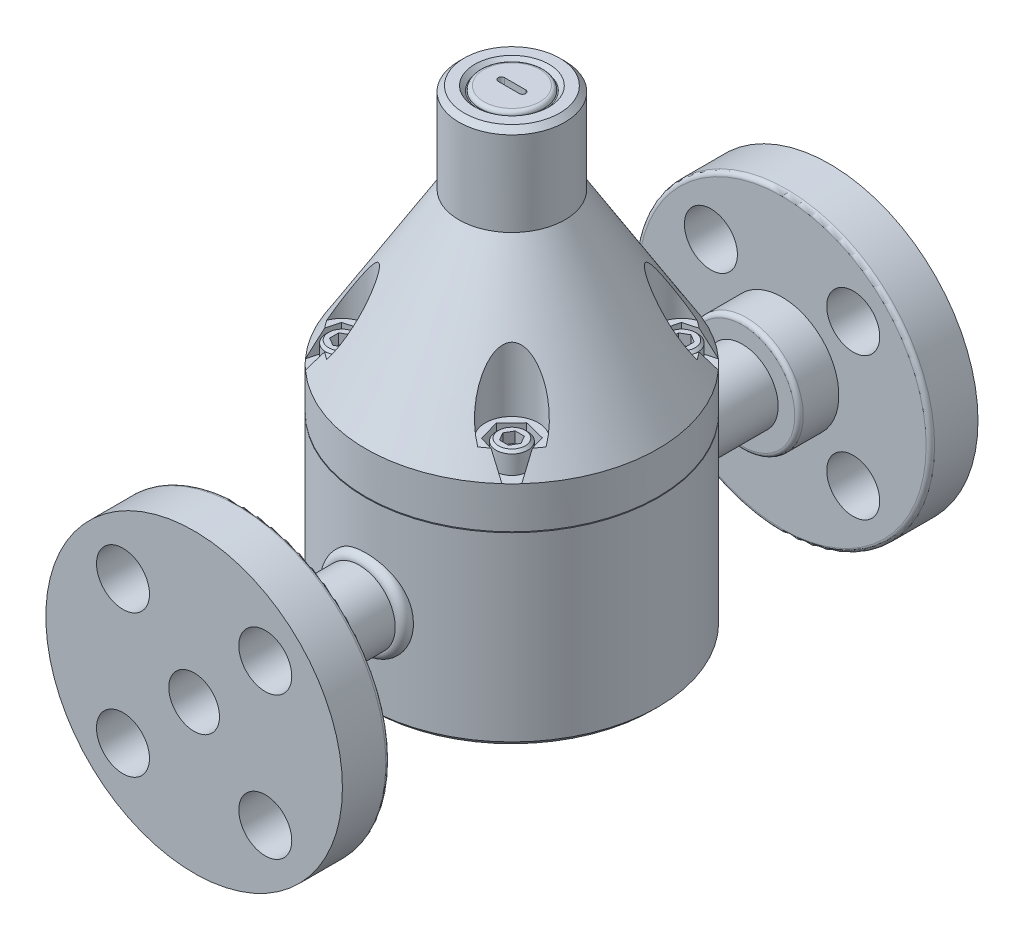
from build123d import *

# Parameters (mm, degrees)
SKETCH1_R                = 43.815
EXTRUDE1_DEPTH           = 140.97
SKETCH3_R                = 11.1125
EXTRUDE2_DEPTH           = 1.27
EXTRUDE2_DRAFT           = -45
CHAMFER1_SIZE            = 1.5748
SKETCH4_R                = 9.525
EXTRUDE3_DEPTH           = 1.27
FILLET1_R                = 1.143
EXTRUDE4_DEPTH           = 3.302
EXTRUDE4_DRAFT           = -1
SKETCH6_R                = 7.9375
EXTRUDE5_DEPTH           = 22.86
EXTRUDE6_DEPTH           = 6.35
CIRPATTERN1_COUNT        = 4
SKETCH9_R                = 4.7625
EXTRUDE7_DEPTH           = 6.35
EXTRUDE8_DEPTH           = 3.175
CIRPATTERN2_COUNT        = 4
CHAMFER2_SIZE            = 0.762
SKETCH11_R               = 44.45
BOSS_EXTRUDE1_DEPTH      = 14.2748
SKETCH12_R               = 17.018
BOSS_EXTRUDE2_DEPTH      = 26.2128
BOSS_EXTRUDE3_REACH      = 204.947
BOSS_EXTRUDE3_END_RADIUS = 43.815
SKETCH13_R               = 10.7696
SKETCH14_R               = 7.5946
CUT_EXTRUDE1_DEPTH       = 25.4
SKETCH15_R               = 7.9375
CUT_EXTRUDE2_DEPTH       = 25.4
CIRPATTERN3_COUNT        = 4
SKETCH18_R               = 44.45
BOSS_EXTRUDE5_DEPTH      = 14.2748
BOSS_EXTRUDE6_START      = 26.2128
SKETCH19_R               = 17.018
BOSS_EXTRUDE6_DEPTH      = 26.2128
BOSS_EXTRUDE7_REACH      = 243.119
BOSS_EXTRUDE7_END_RADIUS = 43.815
SKETCH20_R               = 10.7696
CUT_EXTRUDE3_START       = 25.4
SKETCH21_R               = 7.5946
CUT_EXTRUDE3_DEPTH       = 25.4
CUT_EXTRUDE4_START       = 25.4
SKETCH22_R               = 7.9375
CUT_EXTRUDE4_DEPTH       = 25.4
CIRPATTERN4_COUNT        = 4
FILLET3_R                = 1.27


with BuildPart() as part:
    # Sketch1 → Extrude1 (new body)
    with BuildSketch(Plane(origin=(0, 0, 0), x_dir=(1, 0, 0), z_dir=(0, 1, 0))):
        with Locations(Location((0, 0, 0), (0, 0, 270))):
            Circle(SKETCH1_R)
    extrude(amount=EXTRUDE1_DEPTH)

    # Sketch2 → Cut-Revolve1 (revolve, cut)
    with BuildSketch(Plane.XY, mode=Mode.PRIVATE) as cut_revolve1_sk:
        Polygon((-43.815, 56.134), (-43.815, 68.58), (-15.875, 114.046), (-15.875, 147.034008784), (-49.44729897, 147.034008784), (-49.44729897, 55.88), (-30.226, 55.88), (-30.226, 56.134), align=None)
    revolve(cut_revolve1_sk.sketch.rotate(Axis((0, 0, 0), (0, 1, 0)), 270), axis=Axis((0, 0, 0), (0, 1, 0)), mode=Mode.SUBTRACT)


with BuildPart() as extrude2_tool:
    # Sketch3 → Extrude2 (with draft: the straight prism first)
    with BuildSketch(Plane(origin=(0, 140.97, 0), x_dir=(-1, 0, 0), z_dir=(0, 1, 0))):
        Circle(SKETCH3_R)
    extrude(amount=-EXTRUDE2_DEPTH)
    # Extrude2: the draft: its side faces are tilted about the plane it starts from
    extrude2_sides = [extrude2_tool.faces().sort_by_distance(p)[0] for p in [
        (11.1125, 140.335, 0),
    ]]
    draft(extrude2_sides, Plane(origin=(0, 140.97, 0), x_dir=(-1, 0, 0), z_dir=(0, 1, 0)), EXTRUDE2_DRAFT)


with BuildPart() as part_1:
    add(part.part)

    # Extrude2: cut by extrude2_tool
    add(extrude2_tool.part, mode=Mode.SUBTRACT)

    # Chamfer1
    chamfer1_edges = [part_1.edges().sort_by_distance(p)[0] for p in [
        (0, 0, -43.815),
        (0, 140.97, 15.875),
    ]]
    chamfer(chamfer1_edges, length=CHAMFER1_SIZE)

    # Sketch4 → Extrude3 (add)
    with BuildSketch(Plane(origin=(0, 140.97, 0), x_dir=(-1, 0, 0), z_dir=(0, 1, 0))):
        with Locations(Location((0, 0, 0), (0, 0, 90))):
            Circle(SKETCH4_R)
    extrude(amount=-EXTRUDE3_DEPTH)

    # Fillet1
    fillet1_edges = [part_1.edges().sort_by_distance(p)[0] for p in [
        (0, 140.97, -9.525),
    ]]
    fillet(fillet1_edges, radius=FILLET1_R)


with BuildPart() as extrude4_tool:
    # Sketch5 → Extrude4 (with draft: the straight prism first)
    with BuildSketch(Plane(origin=(0, 140.97, 0), x_dir=(-1, 0, 0), z_dir=(0, 1, 0))):
        with BuildLine():
            Line((3.175, 0.9652), (-3.175, 0.9652))
            ThreePointArc((-3.175, 0.9652), (-4.1402, 0), (-3.175, -0.9652))
            Line((-3.175, -0.9652), (3.175, -0.9652))
            ThreePointArc((3.175, -0.9652), (4.1402, 0), (3.175, 0.9652))
        make_face()
    extrude(amount=-EXTRUDE4_DEPTH)
    # Extrude4: the draft: its side faces are tilted about the plane it starts from
    extrude4_sides = [extrude4_tool.faces().sort_by_distance(p)[0] for p in [
        (-4.1402, 139.319, 0),
        (0, 139.319, 0.9652),
        (4.1402, 139.319, 0),
        (0, 139.319, -0.9652),
    ]]
    draft(extrude4_sides, Plane(origin=(0, 140.97, 0), x_dir=(-1, 0, 0), z_dir=(0, 1, 0)), EXTRUDE4_DRAFT)


with BuildPart() as part_2:
    add(part_1.part)

    # Extrude4: cut by extrude4_tool
    add(extrude4_tool.part, mode=Mode.SUBTRACT)

    # Sketch6 → Extrude5 (cut)
    with BuildSketch(Plane(origin=(0, 74.93, 0), x_dir=(-1, 0, 0), z_dir=(0, 1, 0))):
        with Locations((-25.459026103, 25.459026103)):
            Circle(SKETCH6_R)
    extrude5 = extrude(amount=EXTRUDE5_DEPTH, mode=Mode.SUBTRACT)

    # Sketch8 → Extrude6 (cut)
    with BuildSketch(Plane(origin=(0, 74.93, 0), x_dir=(-1, 0, 0), z_dir=(0, 1, 0))):
        Polygon((-29.948607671, 20.824591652), (-23.690278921, 19.253717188), (-19.200697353, 23.888151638), (-20.969444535, 30.093460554), (-33.591654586, 33.591654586), align=None)
    extrude6 = extrude(amount=-EXTRUDE6_DEPTH, mode=Mode.SUBTRACT)

    # CirPattern1: Extrude5, Extrude6 ×4 about axis
    cirpattern1_axis = Axis((0, 0, 0), (0, 1, 0))
    add([extrude5.rotate(cirpattern1_axis, i * 360 / CIRPATTERN1_COUNT) for i in range(1, CIRPATTERN1_COUNT)], mode=Mode.SUBTRACT)
    add([extrude6.rotate(cirpattern1_axis, i * 360 / CIRPATTERN1_COUNT) for i in range(1, CIRPATTERN1_COUNT)], mode=Mode.SUBTRACT)

    # Sketch9 → Extrude7 (add)
    with BuildSketch(Plane(origin=(0, 74.93, 0), x_dir=(-1, 0, 0), z_dir=(0, 1, 0))):
        with Locations(Location((-25.459026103, 25.459026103, 0), (0, 0, 90))):
            Circle(SKETCH9_R)
    extrude7 = extrude(amount=-EXTRUDE7_DEPTH)

    # Sketch10 → Extrude8 (cut)
    with BuildSketch(Plane(origin=(0, 74.93, 0), x_dir=(-1, 0, 0), z_dir=(0, 1, 0))):
        Polygon((-28.187127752, 25.459026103), (-26.823076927, 23.096420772), (-24.094975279, 23.096420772), (-22.730924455, 25.459026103), (-24.094975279, 27.821631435), (-26.823076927, 27.821631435), align=None)
    extrude8 = extrude(amount=-EXTRUDE8_DEPTH, mode=Mode.SUBTRACT)

    # CirPattern2: Extrude7, Extrude8 ×4 about axis
    cirpattern2_axis = Axis((0, 0, 0), (0, 1, 0))
    add([extrude7.rotate(cirpattern2_axis, i * 360 / CIRPATTERN2_COUNT) for i in range(1, CIRPATTERN2_COUNT)])
    add([extrude8.rotate(cirpattern2_axis, i * 360 / CIRPATTERN2_COUNT) for i in range(1, CIRPATTERN2_COUNT)], mode=Mode.SUBTRACT)

    # Chamfer2
    chamfer2_edges = [part_2.edges().sort_by_distance(p)[0] for p in [
        (25.459026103, 74.93, 20.696526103),
        (-20.696526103, 74.93, 25.459026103),
        (-25.459026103, 74.93, -20.696526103),
        (20.696526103, 74.93, -25.459026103),
    ]]
    chamfer(chamfer2_edges, length=CHAMFER2_SIZE)



with BuildPart() as body_2:
    # Sketch11 → Boss-Extrude1 (new body)
    with BuildSketch(Plane.XY.offset(95.25)):
        with Locations((0, 28.575)):
            Circle(SKETCH11_R)
    extrude(amount=-BOSS_EXTRUDE1_DEPTH)

    # Sketch12 → Boss-Extrude2 (add)
    with BuildSketch(Plane.XY.offset(95.25)):
        with Locations((0, 28.575)):
            Circle(SKETCH12_R)
    extrude(amount=-BOSS_EXTRUDE2_DEPTH)


with BuildPart() as part_3:
    add(part_2.part)

    add(body_2.part)  # Boss-Extrude3 merges body 2
    # Boss-Extrude3: up to this cylinder (the profile starts outside it)
    boss_extrude3_end = Plane(origin=(0, 28.575, 0), z_dir=(0, -1, 0)) * Cylinder(BOSS_EXTRUDE3_END_RADIUS, 498.524, mode=Mode.PRIVATE)
    # Sketch13 → Boss-Extrude3 (add, up to the surface)
    with BuildSketch(Plane.XY.offset(95.25), mode=Mode.PRIVATE) as boss_extrude3_sk1:
        with Locations((0, 28.575)):
            Circle(SKETCH13_R)
    boss_extrude3_tool1 = extrude(boss_extrude3_sk1.sketch, amount=-BOSS_EXTRUDE3_REACH, mode=Mode.PRIVATE) - boss_extrude3_end
    add(boss_extrude3_tool1.solids().sort_by_distance((0, 28.575, 95.25))[0])

    # Sketch14 → Cut-Extrude1 (cut)
    with BuildSketch(Plane.XY.offset(95.25)):
        with Locations((0, 28.575)):
            Circle(SKETCH14_R)
    extrude(amount=-CUT_EXTRUDE1_DEPTH, mode=Mode.SUBTRACT)

    # Sketch15 → Cut-Extrude2 (cut)
    with BuildSketch(Plane.XY.offset(95.25)):
        with Locations((-21.328108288, 49.903108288)):
            Circle(SKETCH15_R)
    cut_extrude2 = extrude(amount=-CUT_EXTRUDE2_DEPTH, mode=Mode.SUBTRACT)

    # CirPattern3: Cut-Extrude2 ×4 about axis
    cirpattern3_axis = Axis((0, 28.575, 0), (0, 0, 1))
    for i in range(1, CIRPATTERN3_COUNT):
        add(cut_extrude2.rotate(cirpattern3_axis, i * 360 / CIRPATTERN3_COUNT), mode=Mode.SUBTRACT)

    # Sketch16 → Revolve1 (revolve)
    with BuildSketch(Plane(origin=(0, 0, 0), x_dir=(0, 0, -1), z_dir=(1, 0, 0)), mode=Mode.PRIVATE) as revolve1_sk:
        with BuildLine():
            Line((-41.255708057, 38.10228525), (-45.737066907, 38.10228525))
            Line((-45.737066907, 38.10228525), (-45.737066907, 39.3446))
            ThreePointArc((-45.737066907, 39.3446), (-43.699332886, 41.596475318), (-41.255708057, 39.793145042))
            Line((-41.255708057, 39.793145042), (-41.255708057, 38.10228525))
        make_face()
    revolve(revolve1_sk.sketch.rotate(Axis((0, 28.575, 95.25), (0, 0, -1)), 90), axis=Axis((0, 28.575, 95.25), (0, 0, -1)))



with BuildPart() as body_2_2:
    # Sketch18 → Boss-Extrude5 (new body)
    with BuildSketch(Plane.XY.offset(-95.25)):
        with Locations((0, 28.575)):
            Circle(SKETCH18_R)
    extrude(amount=BOSS_EXTRUDE5_DEPTH)

    # Sketch19 → Boss-Extrude6 (add)
    with BuildSketch(Plane.XY.offset(-95.25).offset(BOSS_EXTRUDE6_START)):
        with Locations((0, 28.575)):
            Circle(SKETCH19_R)
    extrude(amount=-BOSS_EXTRUDE6_DEPTH)


with BuildPart() as part_4:
    add(part_3.part)

    add(body_2_2.part)  # Boss-Extrude7 merges body 2 2
    # Boss-Extrude7: up to this cylinder (the profile starts outside it)
    boss_extrude7_end = Plane(origin=(0, 28.575, 0), z_dir=(0, -1, 0)) * Cylinder(BOSS_EXTRUDE7_END_RADIUS, 574.868, mode=Mode.PRIVATE)
    # Sketch20 → Boss-Extrude7 (add, up to the surface)
    with BuildSketch(Plane.XY.offset(-95.25), mode=Mode.PRIVATE) as boss_extrude7_sk1:
        with Locations((0, 28.575)):
            Circle(SKETCH20_R)
    boss_extrude7_tool1 = extrude(boss_extrude7_sk1.sketch, amount=BOSS_EXTRUDE7_REACH, mode=Mode.PRIVATE) - boss_extrude7_end
    add(boss_extrude7_tool1.solids().sort_by_distance((0, 28.575, -95.25))[0])

    # Sketch21 → Cut-Extrude3 (cut)
    with BuildSketch(Plane.XY.offset(-95.25).offset(CUT_EXTRUDE3_START)):
        with Locations((0, 28.575)):
            Circle(SKETCH21_R)
    extrude(amount=-CUT_EXTRUDE3_DEPTH, mode=Mode.SUBTRACT)

    # Sketch22 → Cut-Extrude4 (cut)
    with BuildSketch(Plane.XY.offset(-95.25).offset(CUT_EXTRUDE4_START)):
        with Locations((21.328108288, 49.903108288)):
            Circle(SKETCH22_R)
    cut_extrude4 = extrude(amount=-CUT_EXTRUDE4_DEPTH, mode=Mode.SUBTRACT)

    # CirPattern4: Cut-Extrude4 ×4 about axis
    cirpattern4_axis = Axis((0, 28.575, 0), (0, 0, 1))
    for i in range(1, CIRPATTERN4_COUNT):
        add(cut_extrude4.rotate(cirpattern4_axis, i * 360 / CIRPATTERN4_COUNT), mode=Mode.SUBTRACT)

    # Sketch23 → Revolve2 (revolve)
    with BuildSketch(Plane(origin=(0, 0, 0), x_dir=(0, 0, -1), z_dir=(1, 0, 0)), mode=Mode.PRIVATE) as revolve2_sk:
        with BuildLine():
            Line((41.471808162, 41.581880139), (41.471808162, 38.343874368))
            Line((41.471808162, 38.343874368), (46.669872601, 38.343874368))
            Line((46.669872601, 38.343874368), (46.669872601, 39.420616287))
            ThreePointArc((46.669872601, 39.420616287), (44.791850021, 42.235351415), (41.471808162, 41.581880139))
        make_face()
    revolve(revolve2_sk.sketch.rotate(Axis((0, 28.575, -69.0372), (0, 0, 1)), 90), axis=Axis((0, 28.575, -69.0372), (0, 0, 1)))

    # Fillet3
    fillet3_edges = [part_4.edges().sort_by_distance(p)[0] for p in [
        (-44.45, 28.575, 80.9752),
        (-17.018, 28.575, 69.0372),
        (-17.018, 28.575, -69.0372),
        (-44.45, 28.575, -80.9752),
    ]]
    fillet(fillet3_edges, radius=FILLET3_R)


solid = part_4.part
